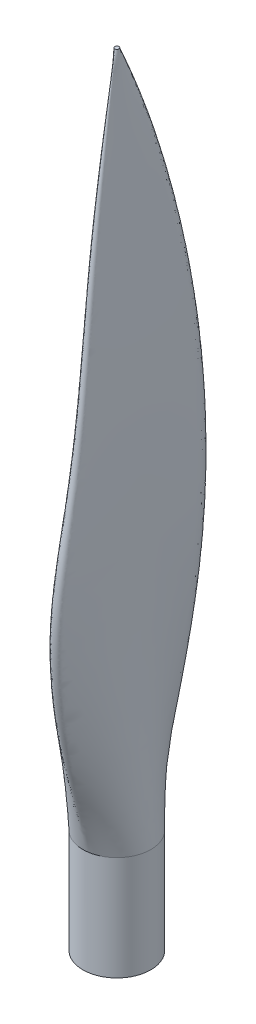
ISO-10303-21;
HEADER;
FILE_DESCRIPTION(('STEP AP214'),'2;1');
FILE_NAME('part.step','',(''),(''),'','','');
FILE_SCHEMA(('AUTOMOTIVE_DESIGN { 1 0 10303 214 1 1 1 1 }'));
ENDSEC;
DATA;
#1=APPLICATION_CONTEXT('core data for automotive mechanical design processes');
#2=APPLICATION_PROTOCOL_DEFINITION('international standard','automotive_design',2000,#1);
#3=PRODUCT_CONTEXT('',#1,'mechanical');
#4=PRODUCT('Part','Part','',(#3));
#5=PRODUCT_RELATED_PRODUCT_CATEGORY('part','',(#4));
#6=PRODUCT_DEFINITION_FORMATION('','',#4);
#7=PRODUCT_DEFINITION_CONTEXT('part definition',#1,'design');
#8=PRODUCT_DEFINITION('design','',#6,#7);
#9=PRODUCT_DEFINITION_SHAPE('','',#8);
#10=(LENGTH_UNIT() NAMED_UNIT(*) SI_UNIT(.MILLI.,.METRE.));
#11=(NAMED_UNIT(*) PLANE_ANGLE_UNIT() SI_UNIT($,.RADIAN.));
#12=(NAMED_UNIT(*) SI_UNIT($,.STERADIAN.) SOLID_ANGLE_UNIT());
#13=UNCERTAINTY_MEASURE_WITH_UNIT(LENGTH_MEASURE(1.E-05),#10,'distance_accuracy_value','');
#14=(GEOMETRIC_REPRESENTATION_CONTEXT(3) GLOBAL_UNCERTAINTY_ASSIGNED_CONTEXT((#13)) GLOBAL_UNIT_ASSIGNED_CONTEXT((#10,
#11,#12)) REPRESENTATION_CONTEXT('',''));
#15=CARTESIAN_POINT('',(0.,0.,0.));
#16=DIRECTION('',(0.,0.,1.));
#17=DIRECTION('',(1.,0.,0.));
#18=AXIS2_PLACEMENT_3D('',#15,#16,#17);
#19=CARTESIAN_POINT('',(0.,25.4,0.));
#20=DIRECTION('',(0.,-1.,0.));
#21=DIRECTION('',(0.,0.,-1.));
#22=AXIS2_PLACEMENT_3D('',#19,#20,#21);
#23=CYLINDRICAL_SURFACE('',#22,8.255);
#24=CARTESIAN_POINT('',(1.84115412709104,25.4,-8.04706011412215));
#25=CARTESIAN_POINT('',(1.723334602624,25.4,-8.07430559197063));
#26=CARTESIAN_POINT('',(1.60488299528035,25.4,-8.09881529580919));
#27=CARTESIAN_POINT('',(1.38248572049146,25.4,-8.13951459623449));
#28=CARTESIAN_POINT('',(1.27866197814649,25.4,-8.15637228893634));
#29=CARTESIAN_POINT('',(1.07958596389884,25.4,-8.18463467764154));
#30=CARTESIAN_POINT('',(0.984382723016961,25.4,-8.19638851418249));
#31=CARTESIAN_POINT('',(0.799099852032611,25.4,-8.21637608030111));
#32=CARTESIAN_POINT('',(0.709037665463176,25.4,-8.22477233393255));
#33=CARTESIAN_POINT('',(0.533014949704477,25.4,-8.23823261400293));
#34=CARTESIAN_POINT('',(0.447065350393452,25.4,-8.2434374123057));
#35=CARTESIAN_POINT('',(0.278401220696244,25.4,-8.25091751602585));
#36=CARTESIAN_POINT('',(0.195691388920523,25.4,-8.25329925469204));
#37=CARTESIAN_POINT('',(0.0326720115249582,25.4,-8.25543618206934));
#38=CARTESIAN_POINT('',(-0.0476365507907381,25.4,-8.25526659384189));
#39=CARTESIAN_POINT('',(-0.206665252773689,25.4,-8.25267257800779));
#40=CARTESIAN_POINT('',(-0.285386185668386,25.4,-8.25029165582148));
#41=CARTESIAN_POINT('',(-0.519156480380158,25.4,-8.24000049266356));
#42=CARTESIAN_POINT('',(-0.67408428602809,25.4,-8.2289659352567));
#43=CARTESIAN_POINT('',(-0.982910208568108,25.4,-8.1978400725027));
#44=CARTESIAN_POINT('',(-1.13680901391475,25.4,-8.17775560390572));
#45=CARTESIAN_POINT('',(-1.3676970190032,25.4,-8.14119064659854));
#46=CARTESIAN_POINT('',(-1.44519414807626,25.4,-8.12781567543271));
#47=CARTESIAN_POINT('',(-1.60126404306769,25.4,-8.09863508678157));
#48=CARTESIAN_POINT('',(-1.6798291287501,25.4,-8.08278797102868));
#49=CARTESIAN_POINT('',(-1.83872582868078,25.4,-8.0482295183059));
#50=CARTESIAN_POINT('',(-1.91904221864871,25.4,-8.02944818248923));
#51=CARTESIAN_POINT('',(-2.0821804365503,25.4,-7.98864095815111));
#52=CARTESIAN_POINT('',(-2.1649777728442,25.4,-7.96651707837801));
#53=CARTESIAN_POINT('',(-2.33387578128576,25.4,-7.91852041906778));
#54=CARTESIAN_POINT('',(-2.4199391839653,25.4,-7.89251695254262));
#55=CARTESIAN_POINT('',(-2.5963455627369,25.4,-7.83639003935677));
#56=CARTESIAN_POINT('',(-2.68663993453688,25.4,-7.80611376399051));
#57=CARTESIAN_POINT('',(-2.87443084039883,25.4,-7.73940404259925));
#58=CARTESIAN_POINT('',(-2.97181775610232,25.4,-7.70265992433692));
#59=CARTESIAN_POINT('',(-3.17880853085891,25.4,-7.61970701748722));
#60=CARTESIAN_POINT('',(-3.28817052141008,25.4,-7.57289599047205));
#61=CARTESIAN_POINT('',(-3.5141185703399,25.4,-7.47066701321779));
#62=CARTESIAN_POINT('',(-3.63052654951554,25.4,-7.41485557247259));
#63=CARTESIAN_POINT('',(-3.86142247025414,25.4,-7.29729943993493));
#64=CARTESIAN_POINT('',(-3.97588921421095,25.4,-7.23551304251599));
#65=CARTESIAN_POINT('',(-4.20261929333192,25.4,-7.10617639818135));
#66=CARTESIAN_POINT('',(-4.31486058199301,25.4,-7.03858754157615));
#67=CARTESIAN_POINT('',(-4.53679222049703,25.4,-6.89766751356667));
#68=CARTESIAN_POINT('',(-4.64645900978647,25.4,-6.82429922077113));
#69=CARTESIAN_POINT('',(-4.86291140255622,25.4,-6.67188200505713));
#70=CARTESIAN_POINT('',(-4.96967174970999,25.4,-6.59279721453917));
#71=CARTESIAN_POINT('',(-5.1799782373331,25.4,-6.42900020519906));
#72=CARTESIAN_POINT('',(-5.28349694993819,25.4,-6.34425276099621));
#73=CARTESIAN_POINT('',(-5.48698233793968,25.4,-6.1691802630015));
#74=CARTESIAN_POINT('',(-5.58691877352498,25.4,-6.07882005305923));
#75=CARTESIAN_POINT('',(-5.78290132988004,25.4,-5.89262570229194));
#76=CARTESIAN_POINT('',(-5.87891502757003,25.4,-5.79675743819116));
#77=CARTESIAN_POINT('',(-6.06673537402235,25.4,-5.59975973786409));
#78=CARTESIAN_POINT('',(-6.15850965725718,25.4,-5.49859945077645));
#79=CARTESIAN_POINT('',(-6.33751905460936,25.4,-5.291221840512));
#80=CARTESIAN_POINT('',(-6.42472185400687,25.4,-5.18497662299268));
#81=CARTESIAN_POINT('',(-6.59425950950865,25.4,-4.96763730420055));
#82=CARTESIAN_POINT('',(-6.67656182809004,25.4,-4.85651781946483));
#83=CARTESIAN_POINT('',(-6.83596797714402,25.4,-4.62963700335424));
#84=CARTESIAN_POINT('',(-6.91303856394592,25.4,-4.51385231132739));
#85=CARTESIAN_POINT('',(-7.06165627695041,25.4,-4.27785124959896));
#86=CARTESIAN_POINT('',(-7.13316881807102,25.4,-4.15761309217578));
#87=CARTESIAN_POINT('',(-7.2703261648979,25.4,-3.91290929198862));
#88=CARTESIAN_POINT('',(-7.33593420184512,25.4,-3.78842303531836));
#89=CARTESIAN_POINT('',(-7.46101265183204,25.4,-3.53552585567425));
#90=CARTESIAN_POINT('',(-7.52044613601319,25.4,-3.40709667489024));
#91=CARTESIAN_POINT('',(-7.63295152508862,25.4,-3.14668071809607));
#92=CARTESIAN_POINT('',(-7.68598834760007,25.4,-3.01467879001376));
#93=CARTESIAN_POINT('',(-7.78546030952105,25.4,-2.74747760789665));
#94=CARTESIAN_POINT('',(-7.8318620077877,25.4,-2.61226590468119));
#95=CARTESIAN_POINT('',(-7.91782821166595,25.4,-2.33900798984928));
#96=CARTESIAN_POINT('',(-7.95736057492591,25.4,-2.2009516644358));
#97=CARTESIAN_POINT('',(-8.02935091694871,25.4,-1.92236713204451));
#98=CARTESIAN_POINT('',(-8.06177747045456,25.4,-1.78183080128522));
#99=CARTESIAN_POINT('',(-8.11932332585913,25.4,-1.49864923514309));
#100=CARTESIAN_POINT('',(-8.14441114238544,25.4,-1.35599759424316));
#101=CARTESIAN_POINT('',(-8.18703308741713,25.4,-1.06895818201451));
#102=CARTESIAN_POINT('',(-8.20453507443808,25.4,-0.924565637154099));
#103=CARTESIAN_POINT('',(-8.23191482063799,25.4,-0.634493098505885));
#104=CARTESIAN_POINT('',(-8.24176258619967,25.4,-0.488810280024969));
#105=CARTESIAN_POINT('',(-8.25377843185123,25.4,-0.196621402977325));
#106=CARTESIAN_POINT('',(-8.25591968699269,25.4,-0.0501142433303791));
#107=CARTESIAN_POINT('',(-8.25246197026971,25.4,0.243258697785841));
#108=CARTESIAN_POINT('',(-8.24683920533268,25.4,0.390124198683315));
#109=CARTESIAN_POINT('',(-8.22779364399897,25.4,0.683748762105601));
#110=CARTESIAN_POINT('',(-8.21434974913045,25.4,0.830506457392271));
#111=CARTESIAN_POINT('',(-8.17960497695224,25.4,1.12345047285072));
#112=CARTESIAN_POINT('',(-8.15828514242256,25.4,1.26963454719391));
#113=CARTESIAN_POINT('',(-8.10772135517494,25.4,1.56096459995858));
#114=CARTESIAN_POINT('',(-8.07845978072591,25.4,1.70610752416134));
#115=CARTESIAN_POINT('',(-8.01199113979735,25.4,1.99488148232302));
#116=CARTESIAN_POINT('',(-7.97476758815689,25.4,2.13850872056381));
#117=CARTESIAN_POINT('',(-7.89255801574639,25.4,2.42379831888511));
#118=CARTESIAN_POINT('',(-7.84755833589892,25.4,2.565456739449));
#119=CARTESIAN_POINT('',(-7.74995568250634,25.4,2.84634902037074));
#120=CARTESIAN_POINT('',(-7.69734226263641,25.4,2.98557925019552));
#121=CARTESIAN_POINT('',(-7.58467786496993,25.4,3.26115607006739));
#122=CARTESIAN_POINT('',(-7.52461966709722,25.4,3.39749970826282));
#123=CARTESIAN_POINT('',(-7.39722804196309,25.4,3.66684254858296));
#124=CARTESIAN_POINT('',(-7.32989039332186,25.4,3.79983975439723));
#125=CARTESIAN_POINT('',(-7.1881092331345,25.4,4.06203292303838));
#126=CARTESIAN_POINT('',(-7.11366406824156,25.4,4.19122799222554));
#127=CARTESIAN_POINT('',(-6.95781375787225,25.4,4.44534423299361));
#128=CARTESIAN_POINT('',(-6.87640889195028,25.4,4.57026557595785));
#129=CARTESIAN_POINT('',(-6.70689844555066,25.4,4.81543060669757));
#130=CARTESIAN_POINT('',(-6.61879446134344,25.4,4.9356753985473));
#131=CARTESIAN_POINT('',(-6.43626033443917,25.4,5.17116747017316));
#132=CARTESIAN_POINT('',(-6.34183329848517,25.4,5.28641715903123));
#133=CARTESIAN_POINT('',(-6.14700187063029,25.4,5.51158258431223));
#134=CARTESIAN_POINT('',(-6.04660243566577,25.4,5.62150261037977));
#135=CARTESIAN_POINT('',(-5.84018168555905,25.4,5.83567634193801));
#136=CARTESIAN_POINT('',(-5.73416725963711,25.4,5.93993668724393));
#137=CARTESIAN_POINT('',(-5.51686915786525,25.4,6.14245545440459));
#138=CARTESIAN_POINT('',(-5.40559418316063,25.4,6.24072321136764));
#139=CARTESIAN_POINT('',(-5.17813187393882,25.4,6.43092710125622));
#140=CARTESIAN_POINT('',(-5.06195474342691,25.4,6.52287543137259));
#141=CARTESIAN_POINT('',(-4.82502908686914,25.4,6.70009021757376));
#142=CARTESIAN_POINT('',(-4.70429174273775,25.4,6.78537162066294));
#143=CARTESIAN_POINT('',(-4.45868519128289,25.4,6.94907718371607));
#144=CARTESIAN_POINT('',(-4.33382687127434,25.4,7.02751768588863));
#145=CARTESIAN_POINT('',(-4.08043390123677,25.4,7.17741874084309));
#146=CARTESIAN_POINT('',(-3.95190981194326,25.4,7.24889715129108));
#147=CARTESIAN_POINT('',(-3.69163321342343,25.4,7.38473946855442));
#148=CARTESIAN_POINT('',(-3.55989122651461,25.4,7.44912353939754));
#149=CARTESIAN_POINT('',(-3.29362830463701,25.4,7.57064456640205));
#150=CARTESIAN_POINT('',(-3.15911790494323,25.4,7.6278046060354));
#151=CARTESIAN_POINT('',(-2.88776753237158,25.4,7.734744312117));
#152=CARTESIAN_POINT('',(-2.75093799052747,25.4,7.78455044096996));
#153=CARTESIAN_POINT('',(-2.47539736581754,25.4,7.87664590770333));
#154=CARTESIAN_POINT('',(-2.33669636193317,25.4,7.91896537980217));
#155=CARTESIAN_POINT('',(-2.0578516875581,25.4,7.99596582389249));
#156=CARTESIAN_POINT('',(-1.91771713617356,25.4,8.03067982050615));
#157=CARTESIAN_POINT('',(-1.63644265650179,25.4,8.09254476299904));
#158=CARTESIAN_POINT('',(-1.49530995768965,25.4,8.11972861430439));
#159=CARTESIAN_POINT('',(-1.21246057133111,25.4,8.1666054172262));
#160=CARTESIAN_POINT('',(-1.07074939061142,25.4,8.18633160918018));
#161=CARTESIAN_POINT('',(-0.787165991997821,25.4,8.21836096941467));
#162=CARTESIAN_POINT('',(-0.645297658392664,25.4,8.23069857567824));
#163=CARTESIAN_POINT('',(-0.361820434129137,25.4,8.24803693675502));
#164=CARTESIAN_POINT('',(-0.220213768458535,25.4,8.25307391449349));
#165=CARTESIAN_POINT('',(0.0623117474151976,25.4,8.25582367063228));
#166=CARTESIAN_POINT('',(0.203230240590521,25.4,8.25357534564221));
#167=CARTESIAN_POINT('',(0.478119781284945,25.4,8.24227762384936));
#168=CARTESIAN_POINT('',(0.61210383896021,25.4,8.2335553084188));
#169=CARTESIAN_POINT('',(0.838414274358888,25.4,8.21289598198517));
#170=CARTESIAN_POINT('',(0.930910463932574,25.4,8.20276610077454));
#171=CARTESIAN_POINT('',(1.10758408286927,25.4,8.18074511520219));
#172=CARTESIAN_POINT('',(1.19178949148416,25.4,8.1690819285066));
#173=CARTESIAN_POINT('',(1.31841417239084,25.4,8.1491217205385));
#174=CARTESIAN_POINT('',(1.36101825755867,25.4,8.14198998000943));
#175=CARTESIAN_POINT('',(1.44841561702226,25.4,8.12692368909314));
#176=CARTESIAN_POINT('',(1.49320499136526,25.4,8.11896661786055));
#177=CARTESIAN_POINT('',(1.66280127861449,25.4,8.08714722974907));
#178=CARTESIAN_POINT('',(1.7870657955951,25.4,8.06035115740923));
#179=CARTESIAN_POINT('',(2.05144374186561,25.4,7.99719399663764));
#180=CARTESIAN_POINT('',(2.19136161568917,25.4,7.96002136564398));
#181=CARTESIAN_POINT('',(2.46992284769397,25.4,7.87802618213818));
#182=CARTESIAN_POINT('',(2.60855224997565,25.4,7.83315603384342));
#183=CARTESIAN_POINT('',(2.88408734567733,25.4,7.73592331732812));
#184=CARTESIAN_POINT('',(3.0209777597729,25.4,7.68351752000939));
#185=CARTESIAN_POINT('',(3.29255586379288,25.4,7.57121277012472));
#186=CARTESIAN_POINT('',(3.42722678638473,25.4,7.51127324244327));
#187=CARTESIAN_POINT('',(3.69389522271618,25.4,7.38394484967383));
#188=CARTESIAN_POINT('',(3.82587434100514,25.4,7.31651745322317));
#189=CARTESIAN_POINT('',(4.08668525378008,25.4,7.17424277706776));
#190=CARTESIAN_POINT('',(4.21549656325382,25.4,7.09935792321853));
#191=CARTESIAN_POINT('',(4.46948508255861,25.4,6.9422271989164));
#192=CARTESIAN_POINT('',(4.59463964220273,25.4,6.85994471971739));
#193=CARTESIAN_POINT('',(4.84087578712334,25.4,6.68828317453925));
#194=CARTESIAN_POINT('',(4.96193492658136,25.4,6.59887192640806));
#195=CARTESIAN_POINT('',(5.19952507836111,25.4,6.41321201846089));
#196=CARTESIAN_POINT('',(5.31603454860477,25.4,6.31693579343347));
#197=CARTESIAN_POINT('',(5.54407126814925,25.4,6.11780877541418));
#198=CARTESIAN_POINT('',(5.65557801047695,25.4,6.01493449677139));
#199=CARTESIAN_POINT('',(5.87315312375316,25.4,5.80287282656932));
#200=CARTESIAN_POINT('',(5.97920189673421,25.4,5.69366532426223));
#201=CARTESIAN_POINT('',(6.18541139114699,25.4,5.4692037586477));
#202=CARTESIAN_POINT('',(6.28555303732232,25.4,5.35393216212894));
#203=CARTESIAN_POINT('',(6.47947260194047,25.4,5.11759744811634));
#204=CARTESIAN_POINT('',(6.57323134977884,25.4,4.99651859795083));
#205=CARTESIAN_POINT('',(6.75405910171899,25.4,4.74899281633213));
#206=CARTESIAN_POINT('',(6.84111043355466,25.4,4.62253298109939));
#207=CARTESIAN_POINT('',(7.00823487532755,25.4,4.36471241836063));
#208=CARTESIAN_POINT('',(7.08829316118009,25.4,4.23334208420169));
#209=CARTESIAN_POINT('',(7.24113048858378,25.4,3.96615938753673));
#210=CARTESIAN_POINT('',(7.31389790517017,25.4,3.83034037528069));
#211=CARTESIAN_POINT('',(7.45185322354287,25.4,3.55472116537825));
#212=CARTESIAN_POINT('',(7.51703281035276,25.4,3.41491680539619));
#213=CARTESIAN_POINT('',(7.63951939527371,25.4,3.131790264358));
#214=CARTESIAN_POINT('',(7.69682120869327,25.4,2.98846583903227));
#215=CARTESIAN_POINT('',(7.80322888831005,25.4,2.69875330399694));
#216=CARTESIAN_POINT('',(7.85233217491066,25.4,2.55236424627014));
#217=CARTESIAN_POINT('',(7.94215828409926,25.4,2.25703268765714));
#218=CARTESIAN_POINT('',(7.98288078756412,25.4,2.10809008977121));
#219=CARTESIAN_POINT('',(8.05591813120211,25.4,1.80820997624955));
#220=CARTESIAN_POINT('',(8.08823566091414,25.4,1.65727311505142));
#221=CARTESIAN_POINT('',(8.14440272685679,25.4,1.35395183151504));
#222=CARTESIAN_POINT('',(8.16825872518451,25.4,1.20156860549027));
#223=CARTESIAN_POINT('',(8.20744942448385,25.4,0.895905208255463));
#224=CARTESIAN_POINT('',(8.22279481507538,25.4,0.742626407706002));
#225=CARTESIAN_POINT('',(8.24491139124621,25.4,0.435722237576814));
#226=CARTESIAN_POINT('',(8.25169765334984,25.4,0.282097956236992));
#227=CARTESIAN_POINT('',(8.25663166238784,25.4,-0.0249468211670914));
#228=CARTESIAN_POINT('',(8.25479874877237,25.4,-0.178367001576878));
#229=CARTESIAN_POINT('',(8.24247513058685,25.4,-0.484461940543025));
#230=CARTESIAN_POINT('',(8.2320067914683,25.4,-0.637137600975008));
#231=CARTESIAN_POINT('',(8.20262957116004,25.4,-0.941245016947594));
#232=CARTESIAN_POINT('',(8.18374418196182,25.4,-1.09267904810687));
#233=CARTESIAN_POINT('',(8.13772392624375,25.4,-1.39381180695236));
#234=CARTESIAN_POINT('',(8.11061456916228,25.4,-1.54351443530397));
#235=CARTESIAN_POINT('',(8.04834332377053,25.4,-1.84069227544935));
#236=CARTESIAN_POINT('',(8.01320973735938,25.4,-1.98817341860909));
#237=CARTESIAN_POINT('',(7.93508329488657,25.4,-2.28041520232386));
#238=CARTESIAN_POINT('',(7.89212203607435,25.4,-2.42518428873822));
#239=CARTESIAN_POINT('',(7.79853762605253,25.4,-2.7115107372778));
#240=CARTESIAN_POINT('',(7.74794955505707,25.4,-2.85307955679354));
#241=CARTESIAN_POINT('',(7.63928944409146,25.4,-3.13251446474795));
#242=CARTESIAN_POINT('',(7.58125543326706,25.4,-3.27039533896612));
#243=CARTESIAN_POINT('',(7.45805470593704,25.4,-3.54209628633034));
#244=CARTESIAN_POINT('',(7.39292526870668,25.4,-3.67593327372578));
#245=CARTESIAN_POINT('',(7.25589935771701,25.4,-3.93922277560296));
#246=CARTESIAN_POINT('',(7.18403935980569,25.4,-4.06869427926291));
#247=CARTESIAN_POINT('',(7.03391130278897,25.4,-4.32292573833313));
#248=CARTESIAN_POINT('',(6.95567988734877,25.4,-4.44770733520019));
#249=CARTESIAN_POINT('',(6.7931673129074,25.4,-4.69223095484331));
#250=CARTESIAN_POINT('',(6.70892361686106,25.4,-4.8119978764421));
#251=CARTESIAN_POINT('',(6.53474853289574,25.4,-5.04616758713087));
#252=CARTESIAN_POINT('',(6.44485578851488,25.3999999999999,-5.16059911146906));
#253=CARTESIAN_POINT('',(6.2597242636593,25.3999999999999,-5.38375979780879));
#254=CARTESIAN_POINT('',(6.1645254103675,25.3999999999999,-5.49252207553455));
#255=CARTESIAN_POINT('',(5.9691771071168,25.4,-5.70412735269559));
#256=CARTESIAN_POINT('',(5.86906605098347,25.4,-5.80700580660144));
#257=CARTESIAN_POINT('',(5.66431985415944,25.4,-6.00672240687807));
#258=CARTESIAN_POINT('',(5.55972019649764,25.4,-6.10359694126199));
#259=CARTESIAN_POINT('',(5.34640763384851,25.4,-6.29117300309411));
#260=CARTESIAN_POINT('',(5.23772823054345,25.4,-6.38191263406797));
#261=CARTESIAN_POINT('',(5.0166694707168,25.4,-6.55708800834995));
#262=CARTESIAN_POINT('',(4.90432223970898,25.4,-6.6415642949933));
#263=CARTESIAN_POINT('',(4.67634096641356,25.4,-6.80408267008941));
#264=CARTESIAN_POINT('',(4.56073806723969,25.4,-6.88216844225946));
#265=CARTESIAN_POINT('',(4.32665283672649,25.4,-7.0317671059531));
#266=CARTESIAN_POINT('',(4.20820088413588,25.4,-7.10332752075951));
#267=CARTESIAN_POINT('',(3.96881088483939,25.4,-7.23978831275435));
#268=CARTESIAN_POINT('',(3.84790130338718,25.4,-7.30473863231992));
#269=CARTESIAN_POINT('',(3.60398064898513,25.4,-7.42802109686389));
#270=CARTESIAN_POINT('',(3.48099445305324,25.4,-7.48640248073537));
#271=CARTESIAN_POINT('',(3.23329039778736,25.4,-7.59658021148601));
#272=CARTESIAN_POINT('',(3.10859439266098,25.4,-7.64842570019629));
#273=CARTESIAN_POINT('',(2.8578420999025,25.4,-7.74556693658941));
#274=CARTESIAN_POINT('',(2.73180510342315,25.4,-7.79091249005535));
#275=CARTESIAN_POINT('',(2.47874102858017,25.4,-7.87508815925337));
#276=CARTESIAN_POINT('',(2.3517309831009,25.4,-7.91396947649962));
#277=CARTESIAN_POINT('',(2.09709154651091,25.4,-7.98524801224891));
#278=CARTESIAN_POINT('',(1.96947706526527,25.4,-8.01769851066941));
#279=CARTESIAN_POINT('',(1.84115412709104,25.4,-8.04706011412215));
#280=B_SPLINE_CURVE_WITH_KNOTS('',3,(#24,#25,#26,#27,#28,#29,#30,#31,#32,#33,#34,#35,#36,#37,
#38,#39,#40,#41,#42,#43,#44,#45,#46,#47,#48,#49,#50,#51,#52,#53,#54,#55,#56,#57,#58,#59,#60,#61,
#62,#63,#64,#65,#66,#67,#68,#69,#70,#71,#72,#73,#74,#75,#76,#77,#78,#79,#80,#81,#82,#83,#84,#85,
#86,#87,#88,#89,#90,#91,#92,#93,#94,#95,#96,#97,#98,#99,#100,#101,#102,#103,#104,#105,#106,#107,
#108,#109,#110,#111,#112,#113,#114,#115,#116,#117,#118,#119,#120,#121,#122,#123,#124,#125,#126,
#127,#128,#129,#130,#131,#132,#133,#134,#135,#136,#137,#138,#139,#140,#141,#142,#143,#144,#145,
#146,#147,#148,#149,#150,#151,#152,#153,#154,#155,#156,#157,#158,#159,#160,#161,#162,#163,#164,
#165,#166,#167,#168,#169,#170,#171,#172,#173,#174,#175,#176,#177,#178,#179,#180,#181,#182,#183,
#184,#185,#186,#187,#188,#189,#190,#191,#192,#193,#194,#195,#196,#197,#198,#199,#200,#201,#202,
#203,#204,#205,#206,#207,#208,#209,#210,#211,#212,#213,#214,#215,#216,#217,#218,#219,#220,#221,
#222,#223,#224,#225,#226,#227,#228,#229,#230,#231,#232,#233,#234,#235,#236,#237,#238,#239,#240,
#241,#242,#243,#244,#245,#246,#247,#248,#249,#250,#251,#252,#253,#254,#255,#256,#257,#258,#259,
#260,#261,#262,#263,#264,#265,#266,#267,#268,#269,#270,#271,#272,#273,#274,#275,#276,#277,#278,
#279),.UNSPECIFIED.,.F.,.F.,(4,2,2,2,2,2,2,2,2,2,2,2,2,2,2,2,2,2,2,2,2,2,2,2,2,2,2,2,2,2,2,2,2,
2,2,2,2,2,2,2,2,2,2,2,2,2,2,2,2,2,2,2,2,2,2,2,2,2,2,2,2,2,2,2,2,2,2,2,2,2,2,2,2,2,2,2,2,2,2,2,2,
2,2,2,2,2,2,2,2,2,2,2,2,2,2,2,2,2,2,2,2,2,2,2,2,2,2,2,2,2,2,2,2,2,2,2,2,2,2,2,2,2,2,2,2,2,2,4),
(0.,0.362752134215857,0.678216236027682,0.9659419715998,1.23725860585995,1.4955337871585,
1.74372604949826,1.98461535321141,2.22086360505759,2.68655561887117,3.15189641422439,
3.38780209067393,3.62820769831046,3.87561771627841,4.13267952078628,4.4023553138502,
4.68801113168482,5.00018711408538,5.35695282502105,5.7441058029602,6.13418870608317,
6.5271052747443,6.92279169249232,7.32122228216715,7.72241622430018,8.12644281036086,
8.53332001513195,8.9429135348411,9.35509291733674,9.76975865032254,10.1868512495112,
10.6063601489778,11.0283228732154,11.452679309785,11.8792664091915,12.3079329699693,
12.7385542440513,13.1710431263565,13.6053611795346,14.0415018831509,14.4793431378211,
14.9187069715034,15.3594202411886,15.8013279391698,16.244306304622,16.68827573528,
17.1331734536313,17.5788607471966,18.0251654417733,18.47190640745,18.9189078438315,
19.3660135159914,19.8131012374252,20.2600827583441,20.7068462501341,21.1532439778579,
21.5991061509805,22.0442550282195,22.4885190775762,22.931756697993,23.3739046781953,
23.8148869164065,24.254581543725,24.6928336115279,25.1294680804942,25.5643029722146,
25.9972105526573,26.4281954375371,26.857236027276,27.2842609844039,27.709159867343,
28.1317939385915,28.5344156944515,28.813519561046,29.0684986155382,29.1980846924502,
29.3345528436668,29.7157469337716,30.1498788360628,30.5867987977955,31.0263333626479,
31.4683456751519,31.9127482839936,32.359515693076,32.8086304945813,33.2599020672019,
33.7131005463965,34.1680128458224,34.6244585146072,35.0823054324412,35.541471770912,
36.0018092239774,36.4630999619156,36.9251148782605,37.3876314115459,37.8504509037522,
38.3134157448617,38.7763982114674,39.2392323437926,39.7017122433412,40.1636099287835,
40.6246928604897,41.0847417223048,41.5436028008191,42.0011911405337,42.4573743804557,
42.9119728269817,43.3647753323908,43.8155553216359,44.2641184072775,44.7104290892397,
45.1544473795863,45.5960713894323,46.0351503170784,46.4714977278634,46.9049167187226,
47.3353657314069,47.7628811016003,48.187435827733,48.6089457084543,49.027279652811,
49.4422718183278,49.85385031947,50.2621029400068,50.6670752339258,51.0687562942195,
51.4670861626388,51.8619635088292),.UNSPECIFIED.);
#281=CARTESIAN_POINT('',(1.84115412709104,25.4,-8.04706011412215));
#282=VERTEX_POINT('',#281);
#283=EDGE_CURVE('E11',#282,#282,#280,.T.);
#284=ORIENTED_EDGE('',*,*,#283,.F.);
#285=EDGE_LOOP('',(#284));
#286=FACE_BOUND('',#285,.T.);
#287=CARTESIAN_POINT('',(0.,0.,0.));
#288=DIRECTION('',(0.,1.,0.));
#289=DIRECTION('',(0.,0.,1.));
#290=AXIS2_PLACEMENT_3D('',#287,#288,#289);
#291=CIRCLE('',#290,8.255);
#292=CARTESIAN_POINT('',(0.,0.,8.255));
#293=VERTEX_POINT('',#292);
#294=EDGE_CURVE('E239',#293,#293,#291,.T.);
#295=ORIENTED_EDGE('',*,*,#294,.T.);
#296=EDGE_LOOP('',(#295));
#297=FACE_BOUND('',#296,.T.);
#298=ADVANCED_FACE('F230',(#286,#297),#23,.T.);
#299=CARTESIAN_POINT('',(0.,0.,0.));
#300=DIRECTION('',(0.,1.,0.));
#301=DIRECTION('',(0.,0.,1.));
#302=AXIS2_PLACEMENT_3D('',#299,#300,#301);
#303=PLANE('',#302);
#304=ORIENTED_EDGE('',*,*,#294,.F.);
#305=EDGE_LOOP('',(#304));
#306=FACE_BOUND('',#305,.T.);
#307=ADVANCED_FACE('F254',(#306),#303,.F.);
#308=CARTESIAN_POINT('',(0.,190.5,0.));
#309=DIRECTION('',(0.,1.,0.));
#310=DIRECTION('',(0.,0.,1.));
#311=AXIS2_PLACEMENT_3D('',#308,#309,#310);
#312=PLANE('',#311);
#313=CARTESIAN_POINT('',(0.,190.5,0.));
#314=DIRECTION('',(0.,1.,0.));
#315=DIRECTION('',(0.,0.,1.));
#316=AXIS2_PLACEMENT_3D('',#313,#314,#315);
#317=CIRCLE('',#316,0.508);
#318=CARTESIAN_POINT('',(0.,190.5,0.508));
#319=VERTEX_POINT('',#318);
#320=EDGE_CURVE('E244',#319,#319,#317,.T.);
#321=ORIENTED_EDGE('',*,*,#320,.T.);
#322=EDGE_LOOP('',(#321));
#323=FACE_BOUND('',#322,.T.);
#324=ADVANCED_FACE('F258',(#323),#312,.T.);
#325=CARTESIAN_POINT('',(1.84115412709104,25.4,-8.04706011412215));
#326=CARTESIAN_POINT('',(3.85400151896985,44.4112593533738,-9.77940812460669));
#327=CARTESIAN_POINT('',(6.93666097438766,71.8608839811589,-12.0005952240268));
#328=CARTESIAN_POINT('',(5.21206920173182,114.301017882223,-14.9054133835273));
#329=CARTESIAN_POINT('',(3.33691933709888,150.580310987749,-11.5017457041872));
#330=CARTESIAN_POINT('',(1.23851319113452,177.991845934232,-4.83404026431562));
#331=CARTESIAN_POINT('',(0.113301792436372,190.5,-0.495203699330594));
#332=CARTESIAN_POINT('',(1.52168320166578,25.4,-8.12015453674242));
#333=CARTESIAN_POINT('',(3.64416796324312,44.4033493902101,-10.0718245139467));
#334=CARTESIAN_POINT('',(6.97789223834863,71.861930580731,-12.614936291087));
#335=CARTESIAN_POINT('',(5.19698338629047,114.301412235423,-15.4213629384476));
#336=CARTESIAN_POINT('',(3.35197002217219,150.574363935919,-11.8665670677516));
#337=CARTESIAN_POINT('',(1.21840282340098,178.003021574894,-4.97201462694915));
#338=CARTESIAN_POINT('',(0.0936420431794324,190.5,-0.499701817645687));
#339=CARTESIAN_POINT('',(1.01228414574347,25.4,-8.20170227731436));
#340=CARTESIAN_POINT('',(3.31433216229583,44.3855968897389,-10.6167788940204));
#341=CARTESIAN_POINT('',(6.81111771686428,71.8643419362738,-13.8775674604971));
#342=CARTESIAN_POINT('',(5.02942877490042,114.302178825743,-16.5272954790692));
#343=CARTESIAN_POINT('',(3.23753716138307,150.561818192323,-12.6452424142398));
#344=CARTESIAN_POINT('',(1.1711537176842,178.026635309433,-5.25283736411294));
#345=CARTESIAN_POINT('',(0.0608066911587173,190.5,-0.505309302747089));
#346=CARTESIAN_POINT('',(0.350564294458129,25.4,-8.25606143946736));
#347=CARTESIAN_POINT('',(2.52989971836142,44.3662390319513,-11.3409296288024));
#348=CARTESIAN_POINT('',(5.90652070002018,71.8665652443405,-15.5843160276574));
#349=CARTESIAN_POINT('',(4.10300751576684,114.303785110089,-18.2553819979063));
#350=CARTESIAN_POINT('',(2.60719211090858,150.542926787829,-13.7890625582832));
#351=CARTESIAN_POINT('',(0.900430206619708,178.061930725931,-5.67625531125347));
#352=CARTESIAN_POINT('',(0.0220848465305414,190.5,-0.50768452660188));
#353=CARTESIAN_POINT('',(-0.250627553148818,25.4,-8.25767047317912));
#354=CARTESIAN_POINT('',(1.57267584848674,44.3550087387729,-11.859510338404));
#355=CARTESIAN_POINT('',(4.45094094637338,71.8675743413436,-16.8528026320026));
#356=CARTESIAN_POINT('',(2.36313907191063,114.305249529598,-19.6793917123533));
#357=CARTESIAN_POINT('',(1.46638568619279,150.528364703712,-14.6637735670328));
#358=CARTESIAN_POINT('',(0.441253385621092,178.089006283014,-5.99749857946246));
#359=CARTESIAN_POINT('',(-0.0150270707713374,190.5,-0.508153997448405));
#360=CARTESIAN_POINT('',(-0.830100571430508,25.3999999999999,-8.2202548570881));
#361=CARTESIAN_POINT('',(0.473600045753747,44.3530986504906,-12.1093767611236));
#362=CARTESIAN_POINT('',(2.65716112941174,71.8675435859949,-17.5307614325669));
#363=CARTESIAN_POINT('',(-0.0219186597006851,114.305882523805,-20.2725527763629));
#364=CARTESIAN_POINT('',(-0.0196292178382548,150.523290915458,-14.973518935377));
#365=CARTESIAN_POINT('',(-0.15451746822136,178.098368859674,-6.10034395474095));
#366=CARTESIAN_POINT('',(-0.0511313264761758,190.5,-0.506105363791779));
#367=CARTESIAN_POINT('',(-1.40471222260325,25.4000000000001,-8.14124832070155));
#368=CARTESIAN_POINT('',(-0.677895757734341,44.3591419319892,-12.0476355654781));
#369=CARTESIAN_POINT('',(0.717906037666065,71.8669117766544,-17.5441371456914));
#370=CARTESIAN_POINT('',(-2.436564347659,114.305262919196,-19.728497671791));
#371=CARTESIAN_POINT('',(-1.47757719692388,150.529987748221,-14.5911226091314));
#372=CARTESIAN_POINT('',(-0.731441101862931,178.085886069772,-5.93254397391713));
#373=CARTESIAN_POINT('',(-0.0868301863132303,190.5,-0.50092627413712));
#374=CARTESIAN_POINT('',(-1.99251299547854,25.3999999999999,-8.01954998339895));
#375=CARTESIAN_POINT('',(-1.7777702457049,44.3725605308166,-11.6622122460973));
#376=CARTESIAN_POINT('',(-1.13795025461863,71.8655494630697,-16.8342529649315));
#377=CARTESIAN_POINT('',(-4.22840319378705,114.303810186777,-18.304235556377));
#378=CARTESIAN_POINT('',(-2.55978909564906,150.545378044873,-13.6838711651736));
#379=CARTESIAN_POINT('',(-1.14725710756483,178.057215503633,-5.56914456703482));
#380=CARTESIAN_POINT('',(-0.122970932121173,190.5,-0.493066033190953));
#381=CARTESIAN_POINT('',(-2.62654134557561,25.4,-7.83540944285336));
#382=CARTESIAN_POINT('',(-2.74974597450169,44.3917026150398,-10.9815820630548));
#383=CARTESIAN_POINT('',(-2.59666530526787,71.8633706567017,-15.4610522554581));
#384=CARTESIAN_POINT('',(-5.18023858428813,114.302184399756,-16.5409822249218));
#385=CARTESIAN_POINT('',(-3.13894845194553,150.564311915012,-12.5447887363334));
#386=CARTESIAN_POINT('',(-1.36996555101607,178.021849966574,-5.12817216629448));
#387=CARTESIAN_POINT('',(-0.160400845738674,190.5,-0.482973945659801));
#388=CARTESIAN_POINT('',(-3.10575910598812,25.4,-7.65523765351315));
#389=CARTESIAN_POINT('',(-3.20544220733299,44.4056883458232,-10.3955190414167));
#390=CARTESIAN_POINT('',(-3.1511423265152,71.8616523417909,-14.2616678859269));
#391=CARTESIAN_POINT('',(-5.34288301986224,114.301236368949,-15.4111202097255));
#392=CARTESIAN_POINT('',(-3.23151750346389,150.57652330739,-11.7797445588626));
#393=CARTESIAN_POINT('',(-1.39115022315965,177.998982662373,-4.84802875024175));
#394=CARTESIAN_POINT('',(-0.191123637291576,190.5,-0.471091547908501));
#395=CARTESIAN_POINT('',(-4.18404589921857,25.4,-7.16807627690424));
#396=CARTESIAN_POINT('',(-4.16084614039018,44.4280876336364,-9.1922721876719));
#397=CARTESIAN_POINT('',(-3.67754796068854,71.8590366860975,-11.9981247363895));
#398=CARTESIAN_POINT('',(-5.37630809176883,114.299459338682,-13.4784786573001));
#399=CARTESIAN_POINT('',(-3.15032223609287,150.597830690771,-10.4667575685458));
#400=CARTESIAN_POINT('',(-1.41617937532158,177.95915327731,-4.34131350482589));
#401=CARTESIAN_POINT('',(-0.257479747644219,190.5,-0.44111238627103));
#402=CARTESIAN_POINT('',(-5.68413352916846,25.4,-6.1917651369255));
#403=CARTESIAN_POINT('',(-5.17121632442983,44.4476951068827,-7.29305542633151));
#404=CARTESIAN_POINT('',(-4.29334065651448,71.8573586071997,-8.67519640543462));
#405=CARTESIAN_POINT('',(-5.27819325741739,114.296743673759,-10.7563266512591));
#406=CARTESIAN_POINT('',(-3.03429665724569,150.624329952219,-8.60235902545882));
#407=CARTESIAN_POINT('',(-1.35561020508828,177.909912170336,-3.65212045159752));
#408=CARTESIAN_POINT('',(-0.349918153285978,190.5,-0.380441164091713));
#409=CARTESIAN_POINT('',(-7.41995862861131,25.4,-3.9770734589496));
#410=CARTESIAN_POINT('',(-6.35887873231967,44.4512716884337,-3.9845009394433));
#411=CARTESIAN_POINT('',(-4.6012724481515,71.8590294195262,-3.70230673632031));
#412=CARTESIAN_POINT('',(-4.82249314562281,114.292498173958,-6.88420754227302));
#413=CARTESIAN_POINT('',(-2.69781663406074,150.654531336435,-5.97160639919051));
#414=CARTESIAN_POINT('',(-1.27944983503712,177.854459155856,-2.6200851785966));
#415=CARTESIAN_POINT('',(-0.456793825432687,190.5,-0.245454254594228));
#416=CARTESIAN_POINT('',(-8.3435335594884,25.4,-1.20233389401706));
#417=CARTESIAN_POINT('',(-6.79368089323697,44.4434939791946,-0.372437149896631));
#418=CARTESIAN_POINT('',(-4.38598245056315,71.8621899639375,1.21033431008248));
#419=CARTESIAN_POINT('',(-4.0787316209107,114.288842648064,-3.18034248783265));
#420=CARTESIAN_POINT('',(-2.26894140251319,150.67603438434,-3.43624502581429));
#421=CARTESIAN_POINT('',(-1.12967303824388,177.815344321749,-1.60779344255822));
#422=CARTESIAN_POINT('',(-0.51273931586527,190.5,-0.0735242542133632));
#423=CARTESIAN_POINT('',(-8.24251389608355,25.4,1.80229392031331));
#424=CARTESIAN_POINT('',(-6.43282781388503,44.4341755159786,3.34168529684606));
#425=CARTESIAN_POINT('',(-3.66846171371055,71.8650487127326,6.03782297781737));
#426=CARTESIAN_POINT('',(-3.06101655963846,114.286223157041,0.373673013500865));
#427=CARTESIAN_POINT('',(-1.73766207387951,150.689890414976,-0.969018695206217));
#428=CARTESIAN_POINT('',(-0.923691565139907,177.79029282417,-0.608588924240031));
#429=CARTESIAN_POINT('',(-0.508282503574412,190.5,0.110923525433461));
#430=CARTESIAN_POINT('',(-7.06596054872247,25.3999999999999,4.61506864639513));
#431=CARTESIAN_POINT('',(-5.22802697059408,44.4242434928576,6.89669235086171));
#432=CARTESIAN_POINT('',(-2.47205405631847,71.8674558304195,10.7671918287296));
#433=CARTESIAN_POINT('',(-1.7806466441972,114.284644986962,3.79156847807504));
#434=CARTESIAN_POINT('',(-1.11069318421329,150.696448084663,1.46419131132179));
#435=CARTESIAN_POINT('',(-0.648477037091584,177.778632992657,0.373736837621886));
#436=CARTESIAN_POINT('',(-0.433951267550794,190.5,0.28346377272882));
#437=CARTESIAN_POINT('',(-4.96524647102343,25.4,6.82075377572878));
#438=CARTESIAN_POINT('',(-3.29683458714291,44.4041430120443,10.0417900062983));
#439=CARTESIAN_POINT('',(-0.788074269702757,71.8712567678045,15.3871979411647));
#440=CARTESIAN_POINT('',(-0.243004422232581,114.283481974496,7.07828674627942));
#441=CARTESIAN_POINT('',(-0.3691742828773,150.695981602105,3.89332259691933));
#442=CARTESIAN_POINT('',(-0.316739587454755,177.780202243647,1.33417929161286));
#443=CARTESIAN_POINT('',(-0.305718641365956,190.5,0.420602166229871));
#444=CARTESIAN_POINT('',(-2.26216437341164,25.4,8.11937908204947));
#445=CARTESIAN_POINT('',(-0.74382415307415,44.3554955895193,12.5735228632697));
#446=CARTESIAN_POINT('',(1.38822268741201,71.879859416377,19.8770250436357));
#447=CARTESIAN_POINT('',(1.55009606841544,114.281798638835,10.2426891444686));
#448=CARTESIAN_POINT('',(0.486998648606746,150.687199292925,6.3414328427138));
#449=CARTESIAN_POINT('',(0.0927088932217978,177.79802026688,2.27865400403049));
#450=CARTESIAN_POINT('',(-0.139557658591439,190.5,0.49884438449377));
#451=CARTESIAN_POINT('',(-0.329370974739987,25.4,8.30161338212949));
#452=CARTESIAN_POINT('',(1.01449351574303,44.2905393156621,13.8211228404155));
#453=CARTESIAN_POINT('',(3.22731838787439,71.8914723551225,22.7486999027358));
#454=CARTESIAN_POINT('',(2.90495721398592,114.279311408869,12.2763095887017));
#455=CARTESIAN_POINT('',(1.19539033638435,150.677093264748,8.01486628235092));
#456=CARTESIAN_POINT('',(0.352493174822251,177.818843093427,2.88044935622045));
#457=CARTESIAN_POINT('',(-0.0202689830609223,190.5,0.510868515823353));
#458=CARTESIAN_POINT('',(0.676360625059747,25.4,8.22754490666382));
#459=CARTESIAN_POINT('',(2.13735028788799,44.2432804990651,14.3431818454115));
#460=CARTESIAN_POINT('',(4.28291865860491,71.8998091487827,24.2529563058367));
#461=CARTESIAN_POINT('',(3.69612032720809,114.277714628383,13.3513187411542));
#462=CARTESIAN_POINT('',(1.58078562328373,150.668301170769,8.91730843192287));
#463=CARTESIAN_POINT('',(0.551171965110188,177.836629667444,3.22138224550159));
#464=CARTESIAN_POINT('',(0.041622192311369,190.5,0.506310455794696));
#465=CARTESIAN_POINT('',(0.792527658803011,25.4,8.21757427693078));
#466=CARTESIAN_POINT('',(2.27203299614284,44.2365682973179,14.4165007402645));
#467=CARTESIAN_POINT('',(4.47288543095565,71.9009923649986,24.456284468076));
#468=CARTESIAN_POINT('',(3.83065268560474,114.277489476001,13.4857990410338));
#469=CARTESIAN_POINT('',(1.65829777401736,150.667041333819,9.05084632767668));
#470=CARTESIAN_POINT('',(0.578015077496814,177.839176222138,3.26919494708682));
#471=CARTESIAN_POINT('',(0.0487709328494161,190.5,0.505696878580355));
#472=CARTESIAN_POINT('',(0.927783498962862,25.4,8.20280704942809));
#473=CARTESIAN_POINT('',(2.51800990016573,44.2273583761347,14.4958918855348));
#474=CARTESIAN_POINT('',(4.88907434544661,71.9025202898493,24.6955271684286));
#475=CARTESIAN_POINT('',(4.07800527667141,114.27736186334,13.6127497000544));
#476=CARTESIAN_POINT('',(1.86519187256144,150.66408614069,9.2498767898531));
#477=CARTESIAN_POINT('',(0.657703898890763,177.84491730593,3.34498110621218));
#478=CARTESIAN_POINT('',(0.0570943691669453,190.5,0.504788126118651));
#479=CARTESIAN_POINT('',(1.05686028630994,25.4,8.187374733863));
#480=CARTESIAN_POINT('',(2.79390920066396,44.2211171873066,14.5229460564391));
#481=CARTESIAN_POINT('',(5.41419689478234,71.903449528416,24.8001436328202));
#482=CARTESIAN_POINT('',(4.35035949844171,114.277476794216,13.6459191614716));
#483=CARTESIAN_POINT('',(2.19090278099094,150.660721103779,9.39896279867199));
#484=CARTESIAN_POINT('',(0.782438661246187,177.851303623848,3.4034077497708));
#485=CARTESIAN_POINT('',(0.0650375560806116,190.5,0.5038384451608));
#486=CARTESIAN_POINT('',(1.18292019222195,25.4,8.17035347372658));
#487=CARTESIAN_POINT('',(3.08046436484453,44.2195010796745,14.4737242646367));
#488=CARTESIAN_POINT('',(5.97705070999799,71.9035954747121,24.6993522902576));
#489=CARTESIAN_POINT('',(4.60771315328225,114.277686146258,13.6096455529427));
#490=CARTESIAN_POINT('',(2.61355210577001,150.658634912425,9.39897146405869));
#491=CARTESIAN_POINT('',(0.948167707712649,177.855182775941,3.40607204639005));
#492=CARTESIAN_POINT('',(0.0727950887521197,190.5,0.502790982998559));
#493=CARTESIAN_POINT('',(1.3091253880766,25.4,8.1508194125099));
#494=CARTESIAN_POINT('',(3.33810662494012,44.2232338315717,14.3535361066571));
#495=CARTESIAN_POINT('',(6.461353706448,71.9029302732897,24.4080274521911));
#496=CARTESIAN_POINT('',(4.83879710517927,114.277825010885,13.4931019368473));
#497=CARTESIAN_POINT('',(2.99514793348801,150.659243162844,9.21318253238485));
#498=CARTESIAN_POINT('',(1.09956755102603,177.853935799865,3.33652222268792));
#499=CARTESIAN_POINT('',(0.0805615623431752,190.5,0.501588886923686));
#500=CARTESIAN_POINT('',(1.43795446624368,25.4,8.12890100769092));
#501=CARTESIAN_POINT('',(3.53777637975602,44.2313355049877,14.1882210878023));
#502=CARTESIAN_POINT('',(6.78065275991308,71.9015681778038,23.9989023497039));
#503=CARTESIAN_POINT('',(5.04254712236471,114.277971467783,13.3103786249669));
#504=CARTESIAN_POINT('',(3.22409228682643,150.661611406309,8.93518716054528));
#505=CARTESIAN_POINT('',(1.19141192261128,177.84930935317,3.23256004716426));
#506=CARTESIAN_POINT('',(0.088489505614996,190.5,0.500240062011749));
#507=CARTESIAN_POINT('',(1.57188601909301,25.4,8.10472671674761));
#508=CARTESIAN_POINT('',(3.68526732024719,44.2419321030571,14.0080134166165));
#509=CARTESIAN_POINT('',(6.93844885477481,71.8997354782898,23.5656129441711));
#510=CARTESIAN_POINT('',(5.1723678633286,114.278260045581,13.0682213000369));
#511=CARTESIAN_POINT('',(3.32436950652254,150.664052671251,8.66373682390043));
#512=CARTESIAN_POINT('',(1.23546984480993,177.844460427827,3.13080914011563));
#513=CARTESIAN_POINT('',(0.0967314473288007,190.5,0.498752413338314));
#514=CARTESIAN_POINT('',(1.68791829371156,25.4,8.08091386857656));
#515=CARTESIAN_POINT('',(3.75413611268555,44.24966431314,13.8939755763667));
#516=CARTESIAN_POINT('',(6.95572971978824,71.8983532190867,23.2987270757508));
#517=CARTESIAN_POINT('',(5.20594098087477,114.278555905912,12.8848753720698));
#518=CARTESIAN_POINT('',(3.33696937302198,150.665257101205,8.50809142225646));
#519=CARTESIAN_POINT('',(1.24197239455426,177.841979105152,3.075776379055));
#520=CARTESIAN_POINT('',(0.103871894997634,190.5,0.497287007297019));
#521=CARTESIAN_POINT('',(2.64339927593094,25.4,7.87259891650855));
#522=CARTESIAN_POINT('',(4.37921262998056,44.3009053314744,13.0846003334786));
#523=CARTESIAN_POINT('',(6.83326389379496,71.8891904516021,21.622140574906));
#524=CARTESIAN_POINT('',(5.25020002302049,114.280521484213,11.6574059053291));
#525=CARTESIAN_POINT('',(3.29673674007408,150.673205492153,7.56788597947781));
#526=CARTESIAN_POINT('',(1.29344892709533,177.825596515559,2.70379156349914));
#527=CARTESIAN_POINT('',(0.162670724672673,190.5,0.484467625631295));
#528=CARTESIAN_POINT('',(4.38853439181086,25.4,7.18352026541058));
#529=CARTESIAN_POINT('',(5.257271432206,44.369613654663,11.5149164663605));
#530=CARTESIAN_POINT('',(6.66327889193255,71.8768425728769,18.5599289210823));
#531=CARTESIAN_POINT('',(5.3084915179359,114.283274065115,9.41697299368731));
#532=CARTESIAN_POINT('',(3.26646827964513,150.683072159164,5.83827946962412));
#533=CARTESIAN_POINT('',(1.31767695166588,177.805078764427,2.07977401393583));
#534=CARTESIAN_POINT('',(0.270223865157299,190.5,0.441252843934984));
#535=CARTESIAN_POINT('',(6.57674432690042,25.4,5.26795635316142));
#536=CARTESIAN_POINT('',(6.53715201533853,44.4139208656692,8.60498360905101));
#537=CARTESIAN_POINT('',(6.41366451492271,71.8690133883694,14.1463694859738));
#538=CARTESIAN_POINT('',(5.39694902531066,114.28479592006,6.07630636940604));
#539=CARTESIAN_POINT('',(3.19873779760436,150.691147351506,3.37488179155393));
#540=CARTESIAN_POINT('',(1.39624418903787,177.788710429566,1.09591759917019));
#541=CARTESIAN_POINT('',(0.405081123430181,190.5,0.32493363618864));
#542=CARTESIAN_POINT('',(7.99550781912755,25.4,2.67031774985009));
#543=CARTESIAN_POINT('',(7.32537533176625,44.4285916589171,5.34400494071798));
#544=CARTESIAN_POINT('',(6.26034972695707,71.8662416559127,9.84393554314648));
#545=CARTESIAN_POINT('',(5.45064472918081,114.285640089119,2.73490849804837));
#546=CARTESIAN_POINT('',(3.16231170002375,150.691519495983,0.965054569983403));
#547=CARTESIAN_POINT('',(1.43494660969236,177.787507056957,0.117820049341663));
#548=CARTESIAN_POINT('',(0.491082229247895,190.5,0.164026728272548));
#549=CARTESIAN_POINT('',(8.42306348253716,25.4,-0.261690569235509));
#550=CARTESIAN_POINT('',(7.57038576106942,44.4362060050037,1.89533868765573));
#551=CARTESIAN_POINT('',(6.21260182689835,71.8642841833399,5.59984429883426));
#552=CARTESIAN_POINT('',(5.46750940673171,114.287062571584,-0.631173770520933));
#553=CARTESIAN_POINT('',(3.14981226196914,150.685054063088,-1.4184939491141));
#554=CARTESIAN_POINT('',(1.44913258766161,177.799080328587,-0.86766329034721));
#555=CARTESIAN_POINT('',(0.519302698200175,190.5,-0.0163536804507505));
#556=CARTESIAN_POINT('',(7.8215263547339,25.4,-3.1154050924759));
#557=CARTESIAN_POINT('',(7.22661496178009,44.4478911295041,-1.51028259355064));
#558=CARTESIAN_POINT('',(6.27966303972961,71.8609962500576,1.34747622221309));
#559=CARTESIAN_POINT('',(5.44372011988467,114.289784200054,-4.03991535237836));
#560=CARTESIAN_POINT('',(3.168207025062,150.671488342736,-3.81556174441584));
#561=CARTESIAN_POINT('',(1.42765855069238,177.823515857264,-1.85316254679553));
#562=CARTESIAN_POINT('',(0.480818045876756,190.5,-0.19109339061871));
#563=CARTESIAN_POINT('',(6.33886405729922,25.3999999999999,-5.52315054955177));
#564=CARTESIAN_POINT('',(6.40183694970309,44.4598364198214,-4.67326686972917));
#565=CARTESIAN_POINT('',(6.44017824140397,71.8570780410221,-2.97245793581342));
#566=CARTESIAN_POINT('',(5.38736296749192,114.293623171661,-7.51875639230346));
#567=CARTESIAN_POINT('',(3.20748085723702,150.650472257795,-6.26377047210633));
#568=CARTESIAN_POINT('',(1.3850391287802,177.86159044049,-2.83803725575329));
#569=CARTESIAN_POINT('',(0.39005858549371,190.5,-0.340572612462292));
#570=CARTESIAN_POINT('',(4.24432684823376,25.4,-7.24161183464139));
#571=CARTESIAN_POINT('',(5.17758074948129,44.4587477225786,-7.47459942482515));
#572=CARTESIAN_POINT('',(6.67917568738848,71.8549963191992,-7.40345636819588));
#573=CARTESIAN_POINT('',(5.30231080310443,114.297899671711,-11.1008504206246));
#574=CARTESIAN_POINT('',(3.27523783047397,150.621092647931,-8.79550106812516));
#575=CARTESIAN_POINT('',(1.30444555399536,177.915449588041,-3.82838236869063));
#576=CARTESIAN_POINT('',(0.261454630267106,190.5,-0.44517155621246));
#577=CARTESIAN_POINT('',(2.64534580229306,25.4,-7.86306238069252));
#578=CARTESIAN_POINT('',(4.38220732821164,44.4311707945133,-9.043319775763));
#579=CARTESIAN_POINT('',(6.83287112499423,71.8582494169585,-10.454138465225));
#580=CARTESIAN_POINT('',(5.25004413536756,114.300025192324,-13.6066337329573));
#581=CARTESIAN_POINT('',(3.29903283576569,150.595281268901,-10.583395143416));
#582=CARTESIAN_POINT('',(1.28913623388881,177.963713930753,-4.48672279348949));
#583=CARTESIAN_POINT('',(0.162790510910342,190.5,-0.48388076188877));
#584=CARTESIAN_POINT('',(1.84115412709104,25.4,-8.04706011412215));
#585=CARTESIAN_POINT('',(3.85400151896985,44.4112593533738,-9.77940812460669));
#586=CARTESIAN_POINT('',(6.93666097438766,71.8608839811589,-12.0005952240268));
#587=CARTESIAN_POINT('',(5.21206920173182,114.301017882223,-14.9054133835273));
#588=CARTESIAN_POINT('',(3.33691933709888,150.580310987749,-11.5017457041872));
#589=CARTESIAN_POINT('',(1.23851319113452,177.991845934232,-4.83404026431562));
#590=CARTESIAN_POINT('',(0.113301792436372,190.5,-0.495203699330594));
#591=B_SPLINE_SURFACE_WITH_KNOTS('',3,3,((#325,#326,#327,#328,#329,#330,#331),(#332,#333,#334,
#335,#336,#337,#338),(#339,#340,#341,#342,#343,#344,#345),(#346,#347,#348,#349,#350,#351,#352),
(#353,#354,#355,#356,#357,#358,#359),(#360,#361,#362,#363,#364,#365,#366),(#367,#368,#369,#370,
#371,#372,#373),(#374,#375,#376,#377,#378,#379,#380),(#381,#382,#383,#384,#385,#386,#387),(#388,
#389,#390,#391,#392,#393,#394),(#395,#396,#397,#398,#399,#400,#401),(#402,#403,#404,#405,#406,
#407,#408),(#409,#410,#411,#412,#413,#414,#415),(#416,#417,#418,#419,#420,#421,#422),(#423,#424,
#425,#426,#427,#428,#429),(#430,#431,#432,#433,#434,#435,#436),(#437,#438,#439,#440,#441,#442,
#443),(#444,#445,#446,#447,#448,#449,#450),(#451,#452,#453,#454,#455,#456,#457),(#458,#459,#460,
#461,#462,#463,#464),(#465,#466,#467,#468,#469,#470,#471),(#472,#473,#474,#475,#476,#477,#478),
(#479,#480,#481,#482,#483,#484,#485),(#486,#487,#488,#489,#490,#491,#492),(#493,#494,#495,#496,
#497,#498,#499),(#500,#501,#502,#503,#504,#505,#506),(#507,#508,#509,#510,#511,#512,#513),(#514,
#515,#516,#517,#518,#519,#520),(#521,#522,#523,#524,#525,#526,#527),(#528,#529,#530,#531,#532,
#533,#534),(#535,#536,#537,#538,#539,#540,#541),(#542,#543,#544,#545,#546,#547,#548),(#549,#550,
#551,#552,#553,#554,#555),(#556,#557,#558,#559,#560,#561,#562),(#563,#564,#565,#566,#567,#568,
#569),(#570,#571,#572,#573,#574,#575,#576),(#577,#578,#579,#580,#581,#582,#583),(#584,#585,#586,
#587,#588,#589,#590)),.UNSPECIFIED.,.T.,.F.,.F.,(4,1,1,1,1,1,1,1,2,1,1,1,1,1,1,1,2,1,1,1,1,1,1,
1,2,1,1,1,1,1,1,1,4),(4,1,1,1,4),(0.,0.0195374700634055,0.039074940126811,0.0586124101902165,
0.0781498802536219,0.0976873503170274,0.117224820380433,0.136762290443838,0.156299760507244,
0.208661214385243,0.261022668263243,0.313384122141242,0.365745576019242,0.418107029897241,
0.47046848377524,0.52282993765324,0.575191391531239,0.579111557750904,0.58303172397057,
0.586951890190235,0.590872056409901,0.594792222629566,0.598712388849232,0.602632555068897,
0.606552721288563,0.655733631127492,0.704914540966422,0.754095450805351,0.803276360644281,
0.852457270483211,0.901638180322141,0.95081909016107,1.),(0.,0.345900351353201,
0.498936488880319,0.766850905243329,1.),.UNSPECIFIED.);
#592=ORIENTED_EDGE('',*,*,#283,.T.);
#593=EDGE_LOOP('',(#592));
#594=FACE_BOUND('',#593,.T.);
#595=ORIENTED_EDGE('',*,*,#320,.F.);
#596=EDGE_LOOP('',(#595));
#597=FACE_BOUND('',#596,.T.);
#598=ADVANCED_FACE('F263',(#594,#597),#591,.T.);
#599=CLOSED_SHELL('',(#298,#307,#324,#598));
#600=MANIFOLD_SOLID_BREP('B2',#599);
#601=ADVANCED_BREP_SHAPE_REPRESENTATION('',(#18,#600),#14);
#602=SHAPE_DEFINITION_REPRESENTATION(#9,#601);
ENDSEC;
END-ISO-10303-21;
